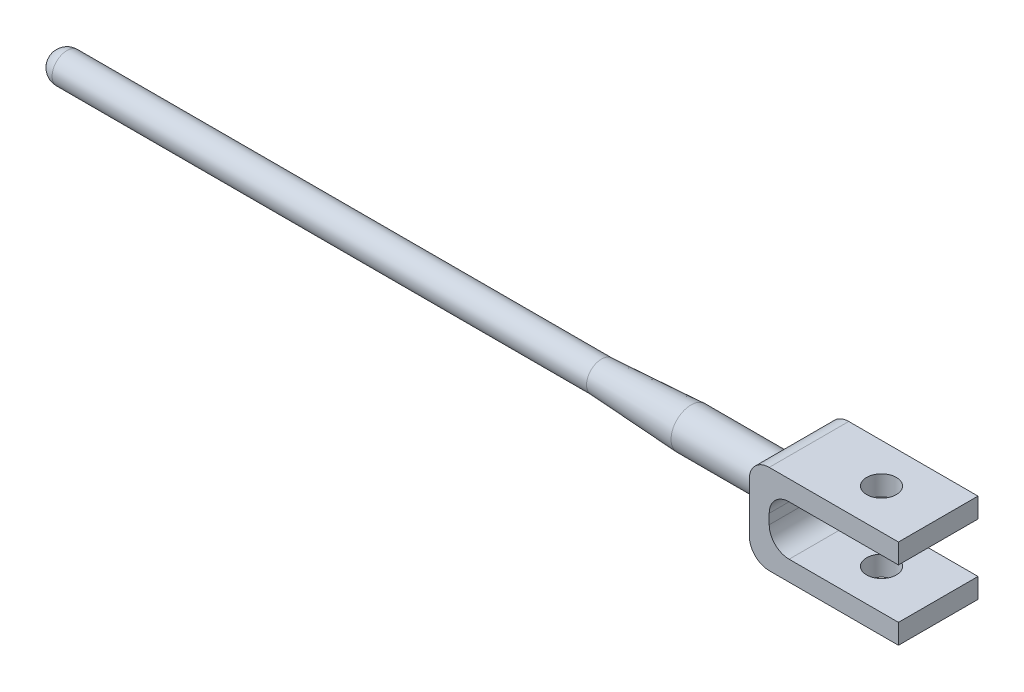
from build123d import *

# Parameters (mm, degrees)
EXTRUSION1_DEPTH        = 8
ESQUISSE2_R             = 1.5
ENL_V_MAT_EXTRU_1_DEPTH = 29.526103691


with BuildPart() as part:
    # Esquisse1 → Extrusion1 (new body)
    with BuildSketch(Plane.XY):
        with BuildLine():
            Line((-10.859980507, 4.5), (-23.859980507, 4.5))
            ThreePointArc((-23.859980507, 4.5), (-25.274194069, 3.914213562), (-25.859980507, 2.5))
            Line((-25.859980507, 2.5), (-25.859980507, -2.5))
            ThreePointArc((-25.859980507, -2.5), (-25.274194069, -3.914213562), (-23.859980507, -4.5))
            Line((-23.859980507, -4.5), (-10.859980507, -4.5))
            Line((-10.859980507, -4.5), (-10.859980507, -2.5))
            Line((-10.859980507, -2.5), (-21.859980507, -2.5))
            ThreePointArc((-21.859980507, -2.5), (-23.274194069, -1.914213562), (-23.859980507, -0.5))
            Line((-23.859980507, -0.5), (-23.859980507, 0.5))
            ThreePointArc((-23.859980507, 0.5), (-23.274194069, 1.914213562), (-21.859980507, 2.5))
            Line((-21.859980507, 2.5), (-10.859980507, 2.5))
            Line((-10.859980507, 2.5), (-10.859980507, 4.5))
        make_face()
    extrude(amount=EXTRUSION1_DEPTH)

    # Esquisse2 → Enl_v. mat.-Extru.1 (cut, through all)
    with BuildSketch(Plane(origin=(0, 4.5, 0), x_dir=(1, 0, 0), z_dir=(0, 1, 0))):
        with Locations(Location((-16.592573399, -3.974515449, 0), (0, 0, 180))):
            Circle(ESQUISSE2_R)
    extrude(amount=-ENL_V_MAT_EXTRU_1_DEPTH, mode=Mode.SUBTRACT)

    # Esquisse4 → R_volution1 (revolve)
    with BuildSketch(Plane(origin=(0, 0, 0), x_dir=(1, 0, 0), z_dir=(0, 1, 0)), mode=Mode.PRIVATE) as r_volution1_sk:
        with BuildLine():
            Line((-25.859980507, -2), (-35.732581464, -2))
            Line((-35.732581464, -2), (-44.732581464, -2.499505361))
            Line((-44.732581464, -2.499505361), (-98.489980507, -2.499505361))
            ThreePointArc((-98.489980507, -2.499505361), (-99.550640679, -2.93884519), (-99.989980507, -3.999505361))
            Line((-99.989980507, -3.999505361), (-25.859980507, -3.999505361))
            Line((-25.859980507, -3.999505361), (-25.859980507, -2))
        make_face()
    revolve(r_volution1_sk.sketch.rotate(Axis((-99.989980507, 0, 3.999505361), (1, 0, 0)), 180), axis=Axis((-99.989980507, 0, 3.999505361), (1, 0, 0)))


solid = part.part
